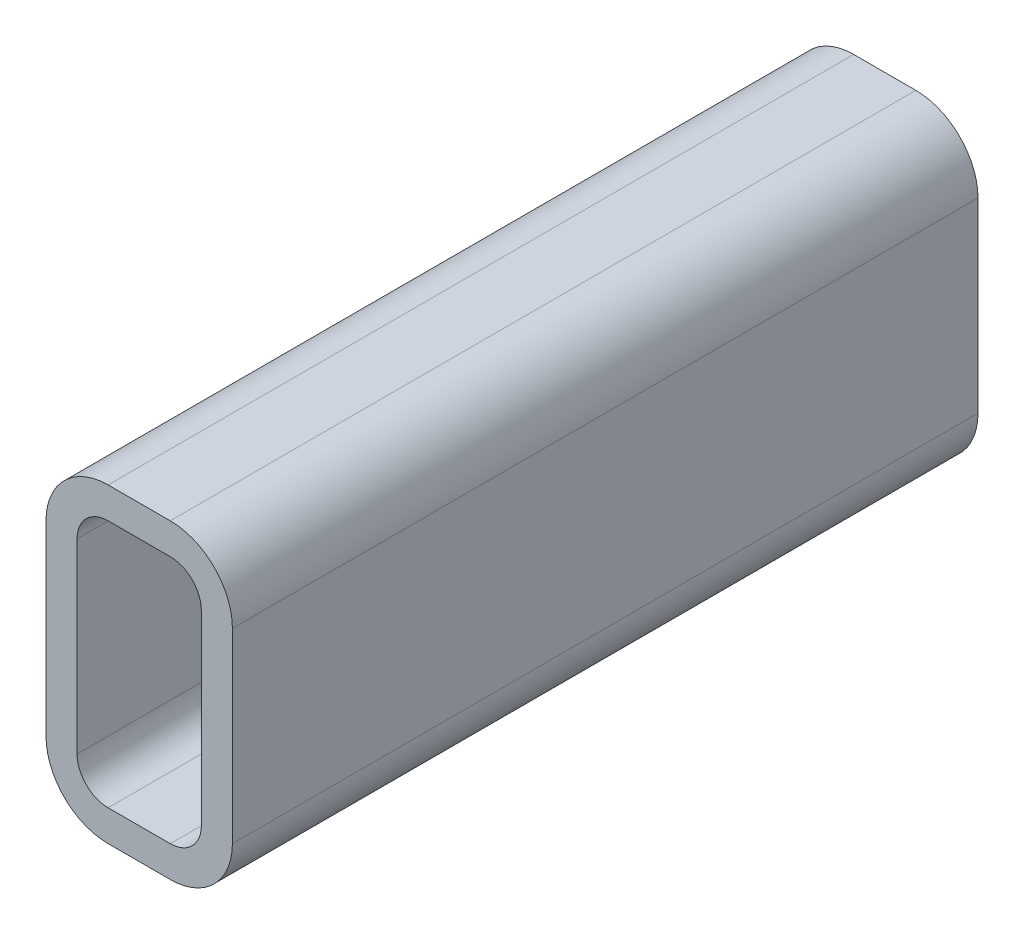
ISO-10303-21;
HEADER;
FILE_DESCRIPTION(('STEP AP214'),'2;1');
FILE_NAME('part.step','',(''),(''),'','','');
FILE_SCHEMA(('AUTOMOTIVE_DESIGN { 1 0 10303 214 1 1 1 1 }'));
ENDSEC;
DATA;
#1=APPLICATION_CONTEXT('core data for automotive mechanical design processes');
#2=APPLICATION_PROTOCOL_DEFINITION('international standard','automotive_design',2000,#1);
#3=PRODUCT_CONTEXT('',#1,'mechanical');
#4=PRODUCT('Part','Part','',(#3));
#5=PRODUCT_RELATED_PRODUCT_CATEGORY('part','',(#4));
#6=PRODUCT_DEFINITION_FORMATION('','',#4);
#7=PRODUCT_DEFINITION_CONTEXT('part definition',#1,'design');
#8=PRODUCT_DEFINITION('design','',#6,#7);
#9=PRODUCT_DEFINITION_SHAPE('','',#8);
#10=(LENGTH_UNIT() NAMED_UNIT(*) SI_UNIT(.MILLI.,.METRE.));
#11=(NAMED_UNIT(*) PLANE_ANGLE_UNIT() SI_UNIT($,.RADIAN.));
#12=(NAMED_UNIT(*) SI_UNIT($,.STERADIAN.) SOLID_ANGLE_UNIT());
#13=UNCERTAINTY_MEASURE_WITH_UNIT(LENGTH_MEASURE(1.E-05),#10,'distance_accuracy_value','');
#14=(GEOMETRIC_REPRESENTATION_CONTEXT(3) GLOBAL_UNCERTAINTY_ASSIGNED_CONTEXT((#13)) GLOBAL_UNIT_ASSIGNED_CONTEXT((#10,
#11,#12)) REPRESENTATION_CONTEXT('',''));
#15=CARTESIAN_POINT('',(0.,0.,0.));
#16=DIRECTION('',(0.,0.,1.));
#17=DIRECTION('',(1.,0.,0.));
#18=AXIS2_PLACEMENT_3D('',#15,#16,#17);
#19=CARTESIAN_POINT('',(27.8891160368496,103.63485662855,304.8));
#20=DIRECTION('',(0.,0.,1.));
#21=DIRECTION('',(1.,0.,0.));
#22=AXIS2_PLACEMENT_3D('',#19,#20,#21);
#23=PLANE('',#22);
#24=CARTESIAN_POINT('',(27.8891160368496,103.63485662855,304.8));
#25=DIRECTION('',(0.,0.,1.));
#26=DIRECTION('',(1.,0.,0.));
#27=AXIS2_PLACEMENT_3D('',#24,#25,#26);
#28=CIRCLE('',#27,25.4);
#29=CARTESIAN_POINT('',(27.8891160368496,129.03485662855,304.8));
#30=VERTEX_POINT('',#29);
#31=CARTESIAN_POINT('',(2.48911603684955,103.63485662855,304.8));
#32=VERTEX_POINT('',#31);
#33=EDGE_CURVE('E211',#30,#32,#28,.T.);
#34=ORIENTED_EDGE('',*,*,#33,.T.);
#35=DIRECTION('',(0.,-1.,0.));
#36=VECTOR('',#35,1.);
#37=CARTESIAN_POINT('',(2.48911603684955,27.43485662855,304.8));
#38=LINE('',#37,#36);
#39=CARTESIAN_POINT('',(2.48911603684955,27.43485662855,304.8));
#40=VERTEX_POINT('',#39);
#41=EDGE_CURVE('E214',#32,#40,#38,.T.);
#42=ORIENTED_EDGE('',*,*,#41,.T.);
#43=CARTESIAN_POINT('',(27.8891160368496,27.43485662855,304.8));
#44=DIRECTION('',(0.,0.,1.));
#45=DIRECTION('',(1.,0.,0.));
#46=AXIS2_PLACEMENT_3D('',#43,#44,#45);
#47=CIRCLE('',#46,25.4);
#48=CARTESIAN_POINT('',(27.8891160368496,2.03485662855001,304.8));
#49=VERTEX_POINT('',#48);
#50=EDGE_CURVE('E217',#40,#49,#47,.T.);
#51=ORIENTED_EDGE('',*,*,#50,.T.);
#52=DIRECTION('',(1.,0.,0.));
#53=VECTOR('',#52,1.);
#54=CARTESIAN_POINT('',(53.2891160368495,2.03485662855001,304.8));
#55=LINE('',#54,#53);
#56=CARTESIAN_POINT('',(53.2891160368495,2.03485662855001,304.8));
#57=VERTEX_POINT('',#56);
#58=EDGE_CURVE('E219',#49,#57,#55,.T.);
#59=ORIENTED_EDGE('',*,*,#58,.T.);
#60=CARTESIAN_POINT('',(53.2891160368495,27.43485662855,304.8));
#61=DIRECTION('',(0.,0.,1.));
#62=DIRECTION('',(1.,0.,0.));
#63=AXIS2_PLACEMENT_3D('',#60,#61,#62);
#64=CIRCLE('',#63,25.4);
#65=CARTESIAN_POINT('',(78.6891160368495,27.43485662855,304.8));
#66=VERTEX_POINT('',#65);
#67=EDGE_CURVE('E221',#57,#66,#64,.T.);
#68=ORIENTED_EDGE('',*,*,#67,.T.);
#69=DIRECTION('',(0.,1.,0.));
#70=VECTOR('',#69,1.);
#71=CARTESIAN_POINT('',(78.6891160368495,103.63485662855,304.8));
#72=LINE('',#71,#70);
#73=CARTESIAN_POINT('',(78.6891160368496,103.63485662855,304.8));
#74=VERTEX_POINT('',#73);
#75=EDGE_CURVE('E223',#66,#74,#72,.T.);
#76=ORIENTED_EDGE('',*,*,#75,.T.);
#77=CARTESIAN_POINT('',(53.2891160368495,103.63485662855,304.8));
#78=DIRECTION('',(0.,0.,1.));
#79=DIRECTION('',(1.,0.,0.));
#80=AXIS2_PLACEMENT_3D('',#77,#78,#79);
#81=CIRCLE('',#80,25.4);
#82=CARTESIAN_POINT('',(53.2891160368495,129.03485662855,304.8));
#83=VERTEX_POINT('',#82);
#84=EDGE_CURVE('E225',#74,#83,#81,.T.);
#85=ORIENTED_EDGE('',*,*,#84,.T.);
#86=DIRECTION('',(-1.,0.,0.));
#87=VECTOR('',#86,1.);
#88=CARTESIAN_POINT('',(27.8891160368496,129.03485662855,304.8));
#89=LINE('',#88,#87);
#90=EDGE_CURVE('E227',#83,#30,#89,.T.);
#91=ORIENTED_EDGE('',*,*,#90,.T.);
#92=EDGE_LOOP('',(#34,#42,#51,#59,#68,#76,#85,#91));
#93=FACE_BOUND('',#92,.T.);
#94=DIRECTION('',(0.,-1.,0.));
#95=VECTOR('',#94,1.);
#96=CARTESIAN_POINT('',(15.1891160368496,27.43485662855,304.8));
#97=LINE('',#96,#95);
#98=CARTESIAN_POINT('',(15.1891160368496,103.63485662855,304.8));
#99=VERTEX_POINT('',#98);
#100=CARTESIAN_POINT('',(15.1891160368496,27.43485662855,304.8));
#101=VERTEX_POINT('',#100);
#102=EDGE_CURVE('E154',#99,#101,#97,.T.);
#103=ORIENTED_EDGE('',*,*,#102,.F.);
#104=CARTESIAN_POINT('',(27.8891160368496,103.63485662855,304.8));
#105=DIRECTION('',(0.,0.,1.));
#106=DIRECTION('',(1.,0.,0.));
#107=AXIS2_PLACEMENT_3D('',#104,#105,#106);
#108=CIRCLE('',#107,12.7);
#109=CARTESIAN_POINT('',(27.8891160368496,116.33485662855,304.8));
#110=VERTEX_POINT('',#109);
#111=EDGE_CURVE('E146',#110,#99,#108,.T.);
#112=ORIENTED_EDGE('',*,*,#111,.F.);
#113=DIRECTION('',(-1.,0.,0.));
#114=VECTOR('',#113,1.);
#115=CARTESIAN_POINT('',(27.8891160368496,116.33485662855,304.8));
#116=LINE('',#115,#114);
#117=CARTESIAN_POINT('',(53.2891160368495,116.33485662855,304.8));
#118=VERTEX_POINT('',#117);
#119=EDGE_CURVE('E179',#118,#110,#116,.T.);
#120=ORIENTED_EDGE('',*,*,#119,.F.);
#121=CARTESIAN_POINT('',(53.2891160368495,103.63485662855,304.8));
#122=DIRECTION('',(0.,0.,1.));
#123=DIRECTION('',(1.,0.,0.));
#124=AXIS2_PLACEMENT_3D('',#121,#122,#123);
#125=CIRCLE('',#124,12.7);
#126=CARTESIAN_POINT('',(65.9891160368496,103.63485662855,304.8));
#127=VERTEX_POINT('',#126);
#128=EDGE_CURVE('E177',#127,#118,#125,.T.);
#129=ORIENTED_EDGE('',*,*,#128,.F.);
#130=DIRECTION('',(0.,1.,0.));
#131=VECTOR('',#130,1.);
#132=CARTESIAN_POINT('',(65.9891160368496,103.63485662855,304.8));
#133=LINE('',#132,#131);
#134=CARTESIAN_POINT('',(65.9891160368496,27.43485662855,304.8));
#135=VERTEX_POINT('',#134);
#136=EDGE_CURVE('E175',#135,#127,#133,.T.);
#137=ORIENTED_EDGE('',*,*,#136,.F.);
#138=CARTESIAN_POINT('',(53.2891160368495,27.43485662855,304.8));
#139=DIRECTION('',(0.,0.,1.));
#140=DIRECTION('',(1.,0.,0.));
#141=AXIS2_PLACEMENT_3D('',#138,#139,#140);
#142=CIRCLE('',#141,12.7);
#143=CARTESIAN_POINT('',(53.2891160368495,14.73485662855,304.8));
#144=VERTEX_POINT('',#143);
#145=EDGE_CURVE('E173',#144,#135,#142,.T.);
#146=ORIENTED_EDGE('',*,*,#145,.F.);
#147=DIRECTION('',(1.,0.,0.));
#148=VECTOR('',#147,1.);
#149=CARTESIAN_POINT('',(53.2891160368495,14.73485662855,304.8));
#150=LINE('',#149,#148);
#151=CARTESIAN_POINT('',(27.8891160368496,14.73485662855,304.8));
#152=VERTEX_POINT('',#151);
#153=EDGE_CURVE('E169',#152,#144,#150,.T.);
#154=ORIENTED_EDGE('',*,*,#153,.F.);
#155=CARTESIAN_POINT('',(27.8891160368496,27.43485662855,304.8));
#156=DIRECTION('',(0.,0.,1.));
#157=DIRECTION('',(1.,0.,0.));
#158=AXIS2_PLACEMENT_3D('',#155,#156,#157);
#159=CIRCLE('',#158,12.7);
#160=EDGE_CURVE('E167',#101,#152,#159,.T.);
#161=ORIENTED_EDGE('',*,*,#160,.F.);
#162=EDGE_LOOP('',(#103,#112,#120,#129,#137,#146,#154,#161));
#163=FACE_BOUND('',#162,.T.);
#164=ADVANCED_FACE('F33',(#93,#163),#23,.T.);
#165=CARTESIAN_POINT('',(27.8891160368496,103.63485662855,0.));
#166=DIRECTION('',(0.,0.,1.));
#167=DIRECTION('',(1.,0.,0.));
#168=AXIS2_PLACEMENT_3D('',#165,#166,#167);
#169=PLANE('',#168);
#170=CARTESIAN_POINT('',(27.8891160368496,103.63485662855,0.));
#171=DIRECTION('',(0.,0.,1.));
#172=DIRECTION('',(1.,0.,0.));
#173=AXIS2_PLACEMENT_3D('',#170,#171,#172);
#174=CIRCLE('',#173,25.4);
#175=CARTESIAN_POINT('',(27.8891160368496,129.03485662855,0.));
#176=VERTEX_POINT('',#175);
#177=CARTESIAN_POINT('',(2.48911603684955,103.63485662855,0.));
#178=VERTEX_POINT('',#177);
#179=EDGE_CURVE('E162',#176,#178,#174,.T.);
#180=ORIENTED_EDGE('',*,*,#179,.F.);
#181=DIRECTION('',(-1.,0.,0.));
#182=VECTOR('',#181,1.);
#183=CARTESIAN_POINT('',(27.8891160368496,129.03485662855,0.));
#184=LINE('',#183,#182);
#185=CARTESIAN_POINT('',(53.2891160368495,129.03485662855,0.));
#186=VERTEX_POINT('',#185);
#187=EDGE_CURVE('E215',#186,#176,#184,.T.);
#188=ORIENTED_EDGE('',*,*,#187,.F.);
#189=CARTESIAN_POINT('',(53.2891160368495,103.63485662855,0.));
#190=DIRECTION('',(0.,0.,1.));
#191=DIRECTION('',(1.,0.,0.));
#192=AXIS2_PLACEMENT_3D('',#189,#190,#191);
#193=CIRCLE('',#192,25.4);
#194=CARTESIAN_POINT('',(78.6891160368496,103.63485662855,0.));
#195=VERTEX_POINT('',#194);
#196=EDGE_CURVE('E242',#195,#186,#193,.T.);
#197=ORIENTED_EDGE('',*,*,#196,.F.);
#198=DIRECTION('',(0.,1.,0.));
#199=VECTOR('',#198,1.);
#200=CARTESIAN_POINT('',(78.6891160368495,103.63485662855,0.));
#201=LINE('',#200,#199);
#202=CARTESIAN_POINT('',(78.6891160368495,27.43485662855,0.));
#203=VERTEX_POINT('',#202);
#204=EDGE_CURVE('E240',#203,#195,#201,.T.);
#205=ORIENTED_EDGE('',*,*,#204,.F.);
#206=CARTESIAN_POINT('',(53.2891160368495,27.43485662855,0.));
#207=DIRECTION('',(0.,0.,1.));
#208=DIRECTION('',(1.,0.,0.));
#209=AXIS2_PLACEMENT_3D('',#206,#207,#208);
#210=CIRCLE('',#209,25.4);
#211=CARTESIAN_POINT('',(53.2891160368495,2.03485662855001,0.));
#212=VERTEX_POINT('',#211);
#213=EDGE_CURVE('E238',#212,#203,#210,.T.);
#214=ORIENTED_EDGE('',*,*,#213,.F.);
#215=DIRECTION('',(1.,0.,0.));
#216=VECTOR('',#215,1.);
#217=CARTESIAN_POINT('',(53.2891160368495,2.03485662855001,0.));
#218=LINE('',#217,#216);
#219=CARTESIAN_POINT('',(27.8891160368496,2.03485662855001,0.));
#220=VERTEX_POINT('',#219);
#221=EDGE_CURVE('E236',#220,#212,#218,.T.);
#222=ORIENTED_EDGE('',*,*,#221,.F.);
#223=CARTESIAN_POINT('',(27.8891160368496,27.43485662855,0.));
#224=DIRECTION('',(0.,0.,1.));
#225=DIRECTION('',(1.,0.,0.));
#226=AXIS2_PLACEMENT_3D('',#223,#224,#225);
#227=CIRCLE('',#226,25.4);
#228=CARTESIAN_POINT('',(2.48911603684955,27.43485662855,0.));
#229=VERTEX_POINT('',#228);
#230=EDGE_CURVE('E234',#229,#220,#227,.T.);
#231=ORIENTED_EDGE('',*,*,#230,.F.);
#232=DIRECTION('',(0.,-1.,0.));
#233=VECTOR('',#232,1.);
#234=CARTESIAN_POINT('',(2.48911603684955,27.43485662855,0.));
#235=LINE('',#234,#233);
#236=EDGE_CURVE('E232',#178,#229,#235,.T.);
#237=ORIENTED_EDGE('',*,*,#236,.F.);
#238=EDGE_LOOP('',(#180,#188,#197,#205,#214,#222,#231,#237));
#239=FACE_BOUND('',#238,.T.);
#240=CARTESIAN_POINT('',(27.8891160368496,103.63485662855,0.));
#241=DIRECTION('',(0.,0.,1.));
#242=DIRECTION('',(1.,0.,0.));
#243=AXIS2_PLACEMENT_3D('',#240,#241,#242);
#244=CIRCLE('',#243,12.7);
#245=CARTESIAN_POINT('',(27.8891160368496,116.33485662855,0.));
#246=VERTEX_POINT('',#245);
#247=CARTESIAN_POINT('',(15.1891160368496,103.63485662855,0.));
#248=VERTEX_POINT('',#247);
#249=EDGE_CURVE('E56',#246,#248,#244,.T.);
#250=ORIENTED_EDGE('',*,*,#249,.T.);
#251=DIRECTION('',(0.,-1.,0.));
#252=VECTOR('',#251,1.);
#253=CARTESIAN_POINT('',(15.1891160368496,27.43485662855,0.));
#254=LINE('',#253,#252);
#255=CARTESIAN_POINT('',(15.1891160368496,27.43485662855,0.));
#256=VERTEX_POINT('',#255);
#257=EDGE_CURVE('E161',#248,#256,#254,.T.);
#258=ORIENTED_EDGE('',*,*,#257,.T.);
#259=CARTESIAN_POINT('',(27.8891160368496,27.43485662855,0.));
#260=DIRECTION('',(0.,0.,1.));
#261=DIRECTION('',(1.,0.,0.));
#262=AXIS2_PLACEMENT_3D('',#259,#260,#261);
#263=CIRCLE('',#262,12.7);
#264=CARTESIAN_POINT('',(27.8891160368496,14.73485662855,0.));
#265=VERTEX_POINT('',#264);
#266=EDGE_CURVE('E183',#256,#265,#263,.T.);
#267=ORIENTED_EDGE('',*,*,#266,.T.);
#268=DIRECTION('',(1.,0.,0.));
#269=VECTOR('',#268,1.);
#270=CARTESIAN_POINT('',(53.2891160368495,14.73485662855,0.));
#271=LINE('',#270,#269);
#272=CARTESIAN_POINT('',(53.2891160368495,14.73485662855,0.));
#273=VERTEX_POINT('',#272);
#274=EDGE_CURVE('E186',#265,#273,#271,.T.);
#275=ORIENTED_EDGE('',*,*,#274,.T.);
#276=CARTESIAN_POINT('',(53.2891160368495,27.43485662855,0.));
#277=DIRECTION('',(0.,0.,1.));
#278=DIRECTION('',(1.,0.,0.));
#279=AXIS2_PLACEMENT_3D('',#276,#277,#278);
#280=CIRCLE('',#279,12.7);
#281=CARTESIAN_POINT('',(65.9891160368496,27.43485662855,0.));
#282=VERTEX_POINT('',#281);
#283=EDGE_CURVE('E189',#273,#282,#280,.T.);
#284=ORIENTED_EDGE('',*,*,#283,.T.);
#285=DIRECTION('',(0.,1.,0.));
#286=VECTOR('',#285,1.);
#287=CARTESIAN_POINT('',(65.9891160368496,103.63485662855,0.));
#288=LINE('',#287,#286);
#289=CARTESIAN_POINT('',(65.9891160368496,103.63485662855,0.));
#290=VERTEX_POINT('',#289);
#291=EDGE_CURVE('E192',#282,#290,#288,.T.);
#292=ORIENTED_EDGE('',*,*,#291,.T.);
#293=CARTESIAN_POINT('',(53.2891160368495,103.63485662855,0.));
#294=DIRECTION('',(0.,0.,1.));
#295=DIRECTION('',(1.,0.,0.));
#296=AXIS2_PLACEMENT_3D('',#293,#294,#295);
#297=CIRCLE('',#296,12.7);
#298=CARTESIAN_POINT('',(53.2891160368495,116.33485662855,0.));
#299=VERTEX_POINT('',#298);
#300=EDGE_CURVE('E195',#290,#299,#297,.T.);
#301=ORIENTED_EDGE('',*,*,#300,.T.);
#302=DIRECTION('',(-1.,0.,0.));
#303=VECTOR('',#302,1.);
#304=CARTESIAN_POINT('',(27.8891160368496,116.33485662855,0.));
#305=LINE('',#304,#303);
#306=EDGE_CURVE('E155',#299,#246,#305,.T.);
#307=ORIENTED_EDGE('',*,*,#306,.T.);
#308=EDGE_LOOP('',(#250,#258,#267,#275,#284,#292,#301,#307));
#309=FACE_BOUND('',#308,.T.);
#310=ADVANCED_FACE('F272',(#239,#309),#169,.F.);
#311=CARTESIAN_POINT('',(27.8891160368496,103.63485662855,304.8));
#312=DIRECTION('',(0.,0.,-1.));
#313=DIRECTION('',(-1.,0.,0.));
#314=AXIS2_PLACEMENT_3D('',#311,#312,#313);
#315=CYLINDRICAL_SURFACE('',#314,25.4);
#316=ORIENTED_EDGE('',*,*,#179,.T.);
#317=DIRECTION('',(0.,0.,-1.));
#318=VECTOR('',#317,1.);
#319=CARTESIAN_POINT('',(2.48911603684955,103.63485662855,304.8));
#320=LINE('',#319,#318);
#321=EDGE_CURVE('E11',#32,#178,#320,.T.);
#322=ORIENTED_EDGE('',*,*,#321,.F.);
#323=ORIENTED_EDGE('',*,*,#33,.F.);
#324=DIRECTION('',(0.,0.,-1.));
#325=VECTOR('',#324,1.);
#326=CARTESIAN_POINT('',(27.8891160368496,129.03485662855,304.8));
#327=LINE('',#326,#325);
#328=EDGE_CURVE('E229',#30,#176,#327,.T.);
#329=ORIENTED_EDGE('',*,*,#328,.T.);
#330=EDGE_LOOP('',(#316,#322,#323,#329));
#331=FACE_BOUND('',#330,.T.);
#332=ADVANCED_FACE('F35',(#331),#315,.T.);
#333=CARTESIAN_POINT('',(2.48911603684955,27.43485662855,304.8));
#334=DIRECTION('',(1.,0.,0.));
#335=DIRECTION('',(0.,0.,-1.));
#336=AXIS2_PLACEMENT_3D('',#333,#334,#335);
#337=PLANE('',#336);
#338=ORIENTED_EDGE('',*,*,#236,.T.);
#339=DIRECTION('',(0.,0.,-1.));
#340=VECTOR('',#339,1.);
#341=CARTESIAN_POINT('',(2.48911603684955,27.43485662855,304.8));
#342=LINE('',#341,#340);
#343=EDGE_CURVE('E41',#40,#229,#342,.T.);
#344=ORIENTED_EDGE('',*,*,#343,.F.);
#345=ORIENTED_EDGE('',*,*,#41,.F.);
#346=ORIENTED_EDGE('',*,*,#321,.T.);
#347=EDGE_LOOP('',(#338,#344,#345,#346));
#348=FACE_BOUND('',#347,.T.);
#349=ADVANCED_FACE('F289',(#348),#337,.F.);
#350=CARTESIAN_POINT('',(27.8891160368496,27.43485662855,304.8));
#351=DIRECTION('',(0.,0.,-1.));
#352=DIRECTION('',(-1.,0.,0.));
#353=AXIS2_PLACEMENT_3D('',#350,#351,#352);
#354=CYLINDRICAL_SURFACE('',#353,25.4);
#355=ORIENTED_EDGE('',*,*,#230,.T.);
#356=DIRECTION('',(0.,0.,-1.));
#357=VECTOR('',#356,1.);
#358=CARTESIAN_POINT('',(27.8891160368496,2.03485662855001,304.8));
#359=LINE('',#358,#357);
#360=EDGE_CURVE('E259',#49,#220,#359,.T.);
#361=ORIENTED_EDGE('',*,*,#360,.F.);
#362=ORIENTED_EDGE('',*,*,#50,.F.);
#363=ORIENTED_EDGE('',*,*,#343,.T.);
#364=EDGE_LOOP('',(#355,#361,#362,#363));
#365=FACE_BOUND('',#364,.T.);
#366=ADVANCED_FACE('F266',(#365),#354,.T.);
#367=CARTESIAN_POINT('',(53.2891160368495,2.03485662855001,304.8));
#368=DIRECTION('',(0.,1.,0.));
#369=DIRECTION('',(0.,0.,1.));
#370=AXIS2_PLACEMENT_3D('',#367,#368,#369);
#371=PLANE('',#370);
#372=ORIENTED_EDGE('',*,*,#221,.T.);
#373=DIRECTION('',(0.,0.,-1.));
#374=VECTOR('',#373,1.);
#375=CARTESIAN_POINT('',(53.2891160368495,2.03485662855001,304.8));
#376=LINE('',#375,#374);
#377=EDGE_CURVE('E256',#57,#212,#376,.T.);
#378=ORIENTED_EDGE('',*,*,#377,.F.);
#379=ORIENTED_EDGE('',*,*,#58,.F.);
#380=ORIENTED_EDGE('',*,*,#360,.T.);
#381=EDGE_LOOP('',(#372,#378,#379,#380));
#382=FACE_BOUND('',#381,.T.);
#383=ADVANCED_FACE('F278',(#382),#371,.F.);
#384=CARTESIAN_POINT('',(53.2891160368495,27.43485662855,304.8));
#385=DIRECTION('',(0.,0.,-1.));
#386=DIRECTION('',(-1.,0.,0.));
#387=AXIS2_PLACEMENT_3D('',#384,#385,#386);
#388=CYLINDRICAL_SURFACE('',#387,25.4);
#389=ORIENTED_EDGE('',*,*,#213,.T.);
#390=DIRECTION('',(0.,0.,-1.));
#391=VECTOR('',#390,1.);
#392=CARTESIAN_POINT('',(78.6891160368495,27.43485662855,304.8));
#393=LINE('',#392,#391);
#394=EDGE_CURVE('E253',#66,#203,#393,.T.);
#395=ORIENTED_EDGE('',*,*,#394,.F.);
#396=ORIENTED_EDGE('',*,*,#67,.F.);
#397=ORIENTED_EDGE('',*,*,#377,.T.);
#398=EDGE_LOOP('',(#389,#395,#396,#397));
#399=FACE_BOUND('',#398,.T.);
#400=ADVANCED_FACE('F282',(#399),#388,.T.);
#401=CARTESIAN_POINT('',(78.6891160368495,103.63485662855,304.8));
#402=DIRECTION('',(-1.,0.,0.));
#403=DIRECTION('',(0.,0.,1.));
#404=AXIS2_PLACEMENT_3D('',#401,#402,#403);
#405=PLANE('',#404);
#406=ORIENTED_EDGE('',*,*,#204,.T.);
#407=DIRECTION('',(0.,0.,-1.));
#408=VECTOR('',#407,1.);
#409=CARTESIAN_POINT('',(78.6891160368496,103.63485662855,304.8));
#410=LINE('',#409,#408);
#411=EDGE_CURVE('E250',#74,#195,#410,.T.);
#412=ORIENTED_EDGE('',*,*,#411,.F.);
#413=ORIENTED_EDGE('',*,*,#75,.F.);
#414=ORIENTED_EDGE('',*,*,#394,.T.);
#415=EDGE_LOOP('',(#406,#412,#413,#414));
#416=FACE_BOUND('',#415,.T.);
#417=ADVANCED_FACE('F302',(#416),#405,.F.);
#418=CARTESIAN_POINT('',(53.2891160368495,103.63485662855,304.8));
#419=DIRECTION('',(0.,0.,-1.));
#420=DIRECTION('',(-1.,0.,0.));
#421=AXIS2_PLACEMENT_3D('',#418,#419,#420);
#422=CYLINDRICAL_SURFACE('',#421,25.4);
#423=ORIENTED_EDGE('',*,*,#196,.T.);
#424=DIRECTION('',(0.,0.,-1.));
#425=VECTOR('',#424,1.);
#426=CARTESIAN_POINT('',(53.2891160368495,129.03485662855,304.8));
#427=LINE('',#426,#425);
#428=EDGE_CURVE('E247',#83,#186,#427,.T.);
#429=ORIENTED_EDGE('',*,*,#428,.F.);
#430=ORIENTED_EDGE('',*,*,#84,.F.);
#431=ORIENTED_EDGE('',*,*,#411,.T.);
#432=EDGE_LOOP('',(#423,#429,#430,#431));
#433=FACE_BOUND('',#432,.T.);
#434=ADVANCED_FACE('F300',(#433),#422,.T.);
#435=CARTESIAN_POINT('',(27.8891160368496,129.03485662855,304.8));
#436=DIRECTION('',(0.,-1.,0.));
#437=DIRECTION('',(0.,0.,-1.));
#438=AXIS2_PLACEMENT_3D('',#435,#436,#437);
#439=PLANE('',#438);
#440=ORIENTED_EDGE('',*,*,#187,.T.);
#441=ORIENTED_EDGE('',*,*,#328,.F.);
#442=ORIENTED_EDGE('',*,*,#90,.F.);
#443=ORIENTED_EDGE('',*,*,#428,.T.);
#444=EDGE_LOOP('',(#440,#441,#442,#443));
#445=FACE_BOUND('',#444,.T.);
#446=ADVANCED_FACE('F295',(#445),#439,.F.);
#447=CARTESIAN_POINT('',(27.8891160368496,103.63485662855,304.8));
#448=DIRECTION('',(0.,0.,-1.));
#449=DIRECTION('',(-1.,0.,0.));
#450=AXIS2_PLACEMENT_3D('',#447,#448,#449);
#451=CYLINDRICAL_SURFACE('',#450,12.7);
#452=ORIENTED_EDGE('',*,*,#249,.F.);
#453=DIRECTION('',(0.,0.,-1.));
#454=VECTOR('',#453,1.);
#455=CARTESIAN_POINT('',(27.8891160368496,116.33485662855,304.8));
#456=LINE('',#455,#454);
#457=EDGE_CURVE('E150',#110,#246,#456,.T.);
#458=ORIENTED_EDGE('',*,*,#457,.F.);
#459=ORIENTED_EDGE('',*,*,#111,.T.);
#460=DIRECTION('',(0.,0.,-1.));
#461=VECTOR('',#460,1.);
#462=CARTESIAN_POINT('',(15.1891160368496,103.63485662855,304.8));
#463=LINE('',#462,#461);
#464=EDGE_CURVE('E149',#99,#248,#463,.T.);
#465=ORIENTED_EDGE('',*,*,#464,.T.);
#466=EDGE_LOOP('',(#452,#458,#459,#465));
#467=FACE_BOUND('',#466,.T.);
#468=ADVANCED_FACE('F148',(#467),#451,.F.);
#469=CARTESIAN_POINT('',(15.1891160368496,27.43485662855,304.8));
#470=DIRECTION('',(1.,0.,0.));
#471=DIRECTION('',(0.,0.,-1.));
#472=AXIS2_PLACEMENT_3D('',#469,#470,#471);
#473=PLANE('',#472);
#474=ORIENTED_EDGE('',*,*,#257,.F.);
#475=ORIENTED_EDGE('',*,*,#464,.F.);
#476=ORIENTED_EDGE('',*,*,#102,.T.);
#477=DIRECTION('',(0.,0.,-1.));
#478=VECTOR('',#477,1.);
#479=CARTESIAN_POINT('',(15.1891160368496,27.43485662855,304.8));
#480=LINE('',#479,#478);
#481=EDGE_CURVE('E163',#101,#256,#480,.T.);
#482=ORIENTED_EDGE('',*,*,#481,.T.);
#483=EDGE_LOOP('',(#474,#475,#476,#482));
#484=FACE_BOUND('',#483,.T.);
#485=ADVANCED_FACE('F158',(#484),#473,.T.);
#486=CARTESIAN_POINT('',(27.8891160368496,27.43485662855,304.8));
#487=DIRECTION('',(0.,0.,-1.));
#488=DIRECTION('',(-1.,0.,0.));
#489=AXIS2_PLACEMENT_3D('',#486,#487,#488);
#490=CYLINDRICAL_SURFACE('',#489,12.7);
#491=ORIENTED_EDGE('',*,*,#266,.F.);
#492=ORIENTED_EDGE('',*,*,#481,.F.);
#493=ORIENTED_EDGE('',*,*,#160,.T.);
#494=DIRECTION('',(0.,0.,-1.));
#495=VECTOR('',#494,1.);
#496=CARTESIAN_POINT('',(27.8891160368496,14.73485662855,304.8));
#497=LINE('',#496,#495);
#498=EDGE_CURVE('E208',#152,#265,#497,.T.);
#499=ORIENTED_EDGE('',*,*,#498,.T.);
#500=EDGE_LOOP('',(#491,#492,#493,#499));
#501=FACE_BOUND('',#500,.T.);
#502=ADVANCED_FACE('F327',(#501),#490,.F.);
#503=CARTESIAN_POINT('',(53.2891160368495,14.73485662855,304.8));
#504=DIRECTION('',(0.,1.,0.));
#505=DIRECTION('',(0.,0.,1.));
#506=AXIS2_PLACEMENT_3D('',#503,#504,#505);
#507=PLANE('',#506);
#508=ORIENTED_EDGE('',*,*,#274,.F.);
#509=ORIENTED_EDGE('',*,*,#498,.F.);
#510=ORIENTED_EDGE('',*,*,#153,.T.);
#511=DIRECTION('',(0.,0.,-1.));
#512=VECTOR('',#511,1.);
#513=CARTESIAN_POINT('',(53.2891160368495,14.73485662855,304.8));
#514=LINE('',#513,#512);
#515=EDGE_CURVE('E206',#144,#273,#514,.T.);
#516=ORIENTED_EDGE('',*,*,#515,.T.);
#517=EDGE_LOOP('',(#508,#509,#510,#516));
#518=FACE_BOUND('',#517,.T.);
#519=ADVANCED_FACE('F331',(#518),#507,.T.);
#520=CARTESIAN_POINT('',(53.2891160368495,27.43485662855,304.8));
#521=DIRECTION('',(0.,0.,-1.));
#522=DIRECTION('',(-1.,0.,0.));
#523=AXIS2_PLACEMENT_3D('',#520,#521,#522);
#524=CYLINDRICAL_SURFACE('',#523,12.7);
#525=ORIENTED_EDGE('',*,*,#283,.F.);
#526=ORIENTED_EDGE('',*,*,#515,.F.);
#527=ORIENTED_EDGE('',*,*,#145,.T.);
#528=DIRECTION('',(0.,0.,-1.));
#529=VECTOR('',#528,1.);
#530=CARTESIAN_POINT('',(65.9891160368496,27.43485662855,304.8));
#531=LINE('',#530,#529);
#532=EDGE_CURVE('E204',#135,#282,#531,.T.);
#533=ORIENTED_EDGE('',*,*,#532,.T.);
#534=EDGE_LOOP('',(#525,#526,#527,#533));
#535=FACE_BOUND('',#534,.T.);
#536=ADVANCED_FACE('F337',(#535),#524,.F.);
#537=CARTESIAN_POINT('',(65.9891160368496,103.63485662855,304.8));
#538=DIRECTION('',(-1.,0.,0.));
#539=DIRECTION('',(0.,0.,1.));
#540=AXIS2_PLACEMENT_3D('',#537,#538,#539);
#541=PLANE('',#540);
#542=ORIENTED_EDGE('',*,*,#291,.F.);
#543=ORIENTED_EDGE('',*,*,#532,.F.);
#544=ORIENTED_EDGE('',*,*,#136,.T.);
#545=DIRECTION('',(0.,0.,-1.));
#546=VECTOR('',#545,1.);
#547=CARTESIAN_POINT('',(65.9891160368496,103.63485662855,304.8));
#548=LINE('',#547,#546);
#549=EDGE_CURVE('E202',#127,#290,#548,.T.);
#550=ORIENTED_EDGE('',*,*,#549,.T.);
#551=EDGE_LOOP('',(#542,#543,#544,#550));
#552=FACE_BOUND('',#551,.T.);
#553=ADVANCED_FACE('F341',(#552),#541,.T.);
#554=CARTESIAN_POINT('',(53.2891160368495,103.63485662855,304.8));
#555=DIRECTION('',(0.,0.,-1.));
#556=DIRECTION('',(-1.,0.,0.));
#557=AXIS2_PLACEMENT_3D('',#554,#555,#556);
#558=CYLINDRICAL_SURFACE('',#557,12.7);
#559=ORIENTED_EDGE('',*,*,#300,.F.);
#560=ORIENTED_EDGE('',*,*,#549,.F.);
#561=ORIENTED_EDGE('',*,*,#128,.T.);
#562=DIRECTION('',(0.,0.,-1.));
#563=VECTOR('',#562,1.);
#564=CARTESIAN_POINT('',(53.2891160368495,116.33485662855,304.8));
#565=LINE('',#564,#563);
#566=EDGE_CURVE('E48',#118,#299,#565,.T.);
#567=ORIENTED_EDGE('',*,*,#566,.T.);
#568=EDGE_LOOP('',(#559,#560,#561,#567));
#569=FACE_BOUND('',#568,.T.);
#570=ADVANCED_FACE('F345',(#569),#558,.F.);
#571=CARTESIAN_POINT('',(27.8891160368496,116.33485662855,304.8));
#572=DIRECTION('',(0.,-1.,0.));
#573=DIRECTION('',(0.,0.,-1.));
#574=AXIS2_PLACEMENT_3D('',#571,#572,#573);
#575=PLANE('',#574);
#576=ORIENTED_EDGE('',*,*,#306,.F.);
#577=ORIENTED_EDGE('',*,*,#566,.F.);
#578=ORIENTED_EDGE('',*,*,#119,.T.);
#579=ORIENTED_EDGE('',*,*,#457,.T.);
#580=EDGE_LOOP('',(#576,#577,#578,#579));
#581=FACE_BOUND('',#580,.T.);
#582=ADVANCED_FACE('F349',(#581),#575,.T.);
#583=CLOSED_SHELL('',(#164,#310,#332,#349,#366,#383,#400,#417,#434,#446,#468,#485,#502,#519,
#536,#553,#570,#582));
#584=MANIFOLD_SOLID_BREP('B2',#583);
#585=ADVANCED_BREP_SHAPE_REPRESENTATION('',(#18,#584),#14);
#586=SHAPE_DEFINITION_REPRESENTATION(#9,#585);
ENDSEC;
END-ISO-10303-21;
